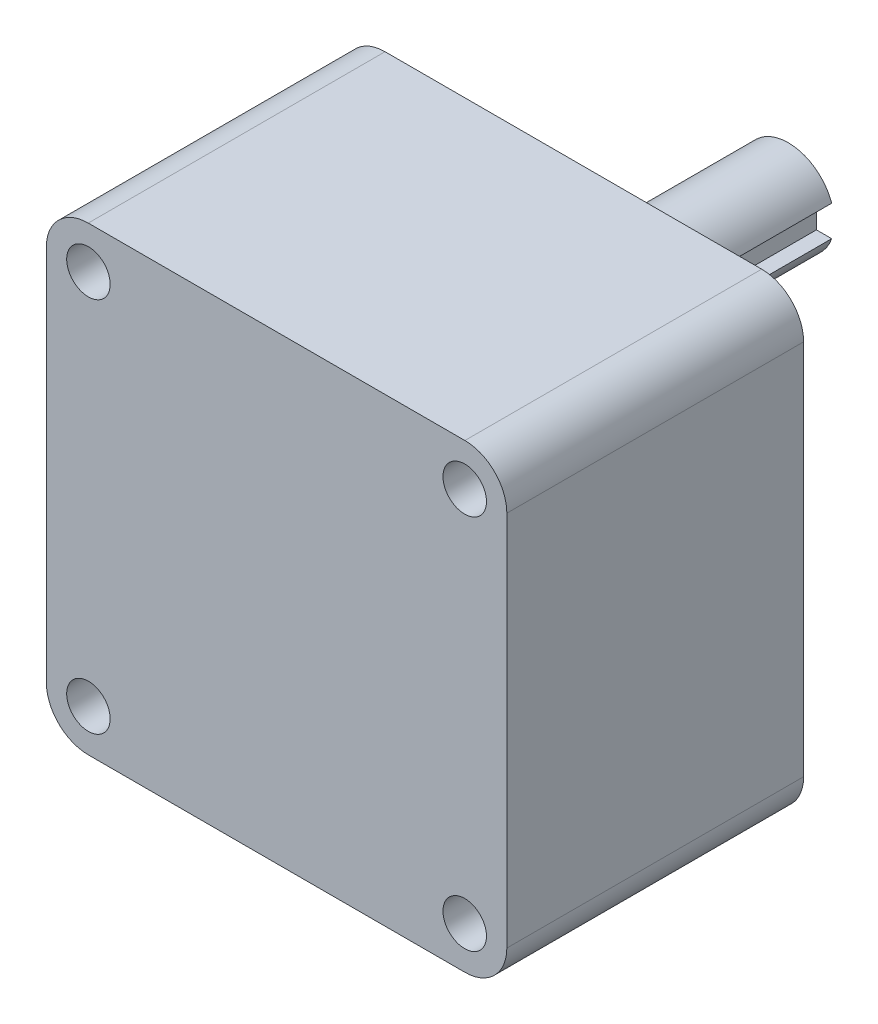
ISO-10303-21;
HEADER;
FILE_DESCRIPTION(('STEP AP214'),'2;1');
FILE_NAME('part.step','',(''),(''),'','','');
FILE_SCHEMA(('AUTOMOTIVE_DESIGN { 1 0 10303 214 1 1 1 1 }'));
ENDSEC;
DATA;
#1=APPLICATION_CONTEXT('core data for automotive mechanical design processes');
#2=APPLICATION_PROTOCOL_DEFINITION('international standard','automotive_design',2000,#1);
#3=PRODUCT_CONTEXT('',#1,'mechanical');
#4=PRODUCT('Part','Part','',(#3));
#5=PRODUCT_RELATED_PRODUCT_CATEGORY('part','',(#4));
#6=PRODUCT_DEFINITION_FORMATION('','',#4);
#7=PRODUCT_DEFINITION_CONTEXT('part definition',#1,'design');
#8=PRODUCT_DEFINITION('design','',#6,#7);
#9=PRODUCT_DEFINITION_SHAPE('','',#8);
#10=(LENGTH_UNIT() NAMED_UNIT(*) SI_UNIT(.MILLI.,.METRE.));
#11=(NAMED_UNIT(*) PLANE_ANGLE_UNIT() SI_UNIT($,.RADIAN.));
#12=(NAMED_UNIT(*) SI_UNIT($,.STERADIAN.) SOLID_ANGLE_UNIT());
#13=UNCERTAINTY_MEASURE_WITH_UNIT(LENGTH_MEASURE(1.E-05),#10,'distance_accuracy_value','');
#14=(GEOMETRIC_REPRESENTATION_CONTEXT(3) GLOBAL_UNCERTAINTY_ASSIGNED_CONTEXT((#13)) GLOBAL_UNIT_ASSIGNED_CONTEXT((#10,
#11,#12)) REPRESENTATION_CONTEXT('',''));
#15=CARTESIAN_POINT('',(0.,0.,0.));
#16=DIRECTION('',(0.,0.,1.));
#17=DIRECTION('',(1.,0.,0.));
#18=AXIS2_PLACEMENT_3D('',#15,#16,#17);
#19=CARTESIAN_POINT('',(0.,21.25,-96.5));
#20=DIRECTION('',(0.,0.,-1.));
#21=DIRECTION('',(0.,-1.,0.));
#22=AXIS2_PLACEMENT_3D('',#19,#20,#21);
#23=PLANE('',#22);
#24=CARTESIAN_POINT('',(0.,18.,-96.5));
#25=DIRECTION('',(0.,0.,1.));
#26=DIRECTION('',(-1.,0.,0.));
#27=AXIS2_PLACEMENT_3D('',#24,#25,#26);
#28=CIRCLE('',#27,2.5);
#29=CARTESIAN_POINT('',(-2.5,18.,-96.5));
#30=VERTEX_POINT('',#29);
#31=EDGE_CURVE('E323',#30,#30,#28,.T.);
#32=ORIENTED_EDGE('',*,*,#31,.T.);
#33=EDGE_LOOP('',(#32));
#34=FACE_BOUND('',#33,.T.);
#35=CARTESIAN_POINT('',(0.,18.,-96.5));
#36=DIRECTION('',(0.,0.,-1.));
#37=DIRECTION('',(1.,0.,0.));
#38=AXIS2_PLACEMENT_3D('',#35,#36,#37);
#39=CIRCLE('',#38,3.25);
#40=CARTESIAN_POINT('',(3.25,18.,-96.5));
#41=VERTEX_POINT('',#40);
#42=EDGE_CURVE('E331',#41,#41,#39,.T.);
#43=ORIENTED_EDGE('',*,*,#42,.T.);
#44=EDGE_LOOP('',(#43));
#45=FACE_BOUND('',#44,.T.);
#46=ADVANCED_FACE('F16',(#34,#45),#23,.T.);
#47=CARTESIAN_POINT('',(5.5,18.,-78.));
#48=DIRECTION('',(1.,0.,0.));
#49=DIRECTION('',(0.,1.,0.));
#50=AXIS2_PLACEMENT_3D('',#47,#48,#49);
#51=PLANE('',#50);
#52=CARTESIAN_POINT('',(5.5,18.,-78.));
#53=DIRECTION('',(1.,0.,0.));
#54=DIRECTION('',(0.,0.,-1.));
#55=AXIS2_PLACEMENT_3D('',#52,#53,#54);
#56=CIRCLE('',#55,3.);
#57=CARTESIAN_POINT('',(5.5,21.,-78.));
#58=VERTEX_POINT('',#57);
#59=CARTESIAN_POINT('',(5.5,15.,-78.));
#60=VERTEX_POINT('',#59);
#61=EDGE_CURVE('E353',#58,#60,#56,.T.);
#62=ORIENTED_EDGE('',*,*,#61,.T.);
#63=DIRECTION('',(0.,0.,-1.));
#64=VECTOR('',#63,1.);
#65=CARTESIAN_POINT('',(5.5,15.,-78.));
#66=LINE('',#65,#64);
#67=CARTESIAN_POINT('',(5.5,15.,-100.));
#68=VERTEX_POINT('',#67);
#69=EDGE_CURVE('E521',#60,#68,#66,.T.);
#70=ORIENTED_EDGE('',*,*,#69,.T.);
#71=DIRECTION('',(0.,1.,0.));
#72=VECTOR('',#71,1.);
#73=CARTESIAN_POINT('',(5.5,18.,-100.));
#74=LINE('',#73,#72);
#75=CARTESIAN_POINT('',(5.5,21.,-100.));
#76=VERTEX_POINT('',#75);
#77=EDGE_CURVE('E30',#68,#76,#74,.T.);
#78=ORIENTED_EDGE('',*,*,#77,.T.);
#79=DIRECTION('',(0.,0.,1.));
#80=VECTOR('',#79,1.);
#81=CARTESIAN_POINT('',(5.5,21.,-100.));
#82=LINE('',#81,#80);
#83=EDGE_CURVE('E10',#76,#58,#82,.T.);
#84=ORIENTED_EDGE('',*,*,#83,.T.);
#85=EDGE_LOOP('',(#62,#70,#78,#84));
#86=FACE_BOUND('',#85,.T.);
#87=ADVANCED_FACE('F752',(#86),#51,.T.);
#88=CARTESIAN_POINT('',(5.5,21.,-100.));
#89=DIRECTION('',(0.,1.,0.));
#90=DIRECTION('',(0.,0.,-1.));
#91=AXIS2_PLACEMENT_3D('',#88,#89,#90);
#92=PLANE('',#91);
#93=ORIENTED_EDGE('',*,*,#83,.F.);
#94=DIRECTION('',(1.,0.,0.));
#95=VECTOR('',#94,1.);
#96=CARTESIAN_POINT('',(0.,21.,-100.));
#97=LINE('',#96,#95);
#98=CARTESIAN_POINT('',(8.48528137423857,21.,-100.));
#99=VERTEX_POINT('',#98);
#100=EDGE_CURVE('E240',#76,#99,#97,.T.);
#101=ORIENTED_EDGE('',*,*,#100,.T.);
#102=DIRECTION('',(0.,0.,-1.));
#103=VECTOR('',#102,1.);
#104=CARTESIAN_POINT('',(8.48528137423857,21.,-36.1567686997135));
#105=LINE('',#104,#103);
#106=CARTESIAN_POINT('',(8.48528137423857,21.,-78.));
#107=VERTEX_POINT('',#106);
#108=EDGE_CURVE('E391',#107,#99,#105,.T.);
#109=ORIENTED_EDGE('',*,*,#108,.F.);
#110=DIRECTION('',(-1.,0.,0.));
#111=VECTOR('',#110,1.);
#112=CARTESIAN_POINT('',(5.5,21.,-78.));
#113=LINE('',#112,#111);
#114=EDGE_CURVE('E369',#107,#58,#113,.T.);
#115=ORIENTED_EDGE('',*,*,#114,.T.);
#116=EDGE_LOOP('',(#93,#101,#109,#115));
#117=FACE_BOUND('',#116,.T.);
#118=ADVANCED_FACE('F782',(#117),#92,.F.);
#119=CARTESIAN_POINT('',(0.,18.,-100.));
#120=DIRECTION('',(0.,0.,1.));
#121=DIRECTION('',(1.,0.,0.));
#122=AXIS2_PLACEMENT_3D('',#119,#120,#121);
#123=PLANE('',#122);
#124=CARTESIAN_POINT('',(0.,18.,-99.9999999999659));
#125=DIRECTION('',(0.,0.,-1.));
#126=DIRECTION('',(-1.,0.,0.));
#127=AXIS2_PLACEMENT_3D('',#124,#125,#126);
#128=CIRCLE('',#127,3.82735026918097);
#129=CARTESIAN_POINT('',(-3.82735026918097,18.,-99.9999999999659));
#130=VERTEX_POINT('',#129);
#131=EDGE_CURVE('E339',#130,#130,#128,.T.);
#132=ORIENTED_EDGE('',*,*,#131,.F.);
#133=EDGE_LOOP('',(#132));
#134=FACE_BOUND('',#133,.T.);
#135=DIRECTION('',(1.,0.,0.));
#136=VECTOR('',#135,1.);
#137=CARTESIAN_POINT('',(5.5,15.,-100.));
#138=LINE('',#137,#136);
#139=CARTESIAN_POINT('',(8.48528137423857,15.,-100.));
#140=VERTEX_POINT('',#139);
#141=EDGE_CURVE('E226',#68,#140,#138,.T.);
#142=ORIENTED_EDGE('',*,*,#141,.T.);
#143=CARTESIAN_POINT('',(0.,18.,-100.));
#144=DIRECTION('',(0.,0.,1.));
#145=DIRECTION('',(1.,0.,0.));
#146=AXIS2_PLACEMENT_3D('',#143,#144,#145);
#147=CIRCLE('',#146,9.);
#148=EDGE_CURVE('E390',#99,#140,#147,.T.);
#149=ORIENTED_EDGE('',*,*,#148,.F.);
#150=ORIENTED_EDGE('',*,*,#100,.F.);
#151=ORIENTED_EDGE('',*,*,#77,.F.);
#152=EDGE_LOOP('',(#142,#149,#150,#151));
#153=FACE_BOUND('',#152,.T.);
#154=ADVANCED_FACE('F777',(#134,#153),#123,.F.);
#155=CARTESIAN_POINT('',(5.5,15.,-78.));
#156=DIRECTION('',(0.,-1.,0.));
#157=DIRECTION('',(0.,0.,-1.));
#158=AXIS2_PLACEMENT_3D('',#155,#156,#157);
#159=PLANE('',#158);
#160=ORIENTED_EDGE('',*,*,#69,.F.);
#161=DIRECTION('',(1.,0.,0.));
#162=VECTOR('',#161,1.);
#163=CARTESIAN_POINT('',(5.5,15.,-78.));
#164=LINE('',#163,#162);
#165=CARTESIAN_POINT('',(8.48528137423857,15.,-78.));
#166=VERTEX_POINT('',#165);
#167=EDGE_CURVE('E464',#60,#166,#164,.T.);
#168=ORIENTED_EDGE('',*,*,#167,.T.);
#169=DIRECTION('',(0.,0.,1.));
#170=VECTOR('',#169,1.);
#171=CARTESIAN_POINT('',(8.48528137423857,15.,-36.1567686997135));
#172=LINE('',#171,#170);
#173=EDGE_CURVE('E361',#140,#166,#172,.T.);
#174=ORIENTED_EDGE('',*,*,#173,.F.);
#175=ORIENTED_EDGE('',*,*,#141,.F.);
#176=EDGE_LOOP('',(#160,#168,#174,#175));
#177=FACE_BOUND('',#176,.T.);
#178=ADVANCED_FACE('F476',(#177),#159,.F.);
#179=CARTESIAN_POINT('',(5.5,18.,-78.));
#180=DIRECTION('',(1.,0.,0.));
#181=DIRECTION('',(0.,0.,-1.));
#182=AXIS2_PLACEMENT_3D('',#179,#180,#181);
#183=CYLINDRICAL_SURFACE('',#182,3.);
#184=ORIENTED_EDGE('',*,*,#61,.F.);
#185=ORIENTED_EDGE('',*,*,#114,.F.);
#186=CARTESIAN_POINT('',(9.,18.,-75.));
#187=CARTESIAN_POINT('',(9.00000060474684,18.0397618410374,-74.999998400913));
#188=CARTESIAN_POINT('',(8.99973651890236,18.079524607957,-75.0007637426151));
#189=CARTESIAN_POINT('',(8.99868599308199,18.1587759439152,-75.0038396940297));
#190=CARTESIAN_POINT('',(8.99790227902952,18.1982648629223,-75.0061422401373));
#191=CARTESIAN_POINT('',(8.99582327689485,18.2769620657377,-75.0122922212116));
#192=CARTESIAN_POINT('',(8.99452989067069,18.3161708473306,-75.0161339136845));
#193=CARTESIAN_POINT('',(8.99144324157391,18.3943011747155,-75.0253593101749));
#194=CARTESIAN_POINT('',(8.98965106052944,18.4332231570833,-75.0307396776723));
#195=CARTESIAN_POINT('',(8.98557826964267,18.5107739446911,-75.0430401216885));
#196=CARTESIAN_POINT('',(8.98329794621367,18.5494029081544,-75.0499592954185));
#197=CARTESIAN_POINT('',(8.97826035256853,18.6263621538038,-75.0653348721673));
#198=CARTESIAN_POINT('',(8.97550261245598,18.6646921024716,-75.0737927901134));
#199=CARTESIAN_POINT('',(8.96952159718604,18.7410483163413,-75.0922434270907));
#200=CARTESIAN_POINT('',(8.96629714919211,18.7790735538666,-75.1022400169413));
#201=CARTESIAN_POINT('',(8.95939407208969,18.8548157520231,-75.1237657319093));
#202=CARTESIAN_POINT('',(8.95571363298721,18.8925308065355,-75.1353009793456));
#203=CARTESIAN_POINT('',(8.94790981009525,18.9676486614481,-75.1599015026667));
#204=CARTESIAN_POINT('',(8.94378405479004,19.005048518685,-75.1729750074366));
#205=CARTESIAN_POINT('',(8.93510084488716,19.0795317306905,-75.2006510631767));
#206=CARTESIAN_POINT('',(8.93054054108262,19.1166109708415,-75.2152637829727));
#207=CARTESIAN_POINT('',(8.92107986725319,19.1898254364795,-75.2457515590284));
#208=CARTESIAN_POINT('',(8.91618273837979,19.2259660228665,-75.2616147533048));
#209=CARTESIAN_POINT('',(8.90607040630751,19.2973835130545,-75.2946235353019));
#210=CARTESIAN_POINT('',(8.90085696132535,19.3326638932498,-75.3117621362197));
#211=CARTESIAN_POINT('',(8.89014197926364,19.4023601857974,-75.3473208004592));
#212=CARTESIAN_POINT('',(8.88464158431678,19.4367788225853,-75.3657358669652));
#213=CARTESIAN_POINT('',(8.87338178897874,19.5047523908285,-75.4038451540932));
#214=CARTESIAN_POINT('',(8.86762300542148,19.5383091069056,-75.4235363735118));
#215=CARTESIAN_POINT('',(8.85587476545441,19.6045600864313,-75.4641960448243));
#216=CARTESIAN_POINT('',(8.84988549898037,19.6372550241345,-75.4851634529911));
#217=CARTESIAN_POINT('',(8.83770380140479,19.7017844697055,-75.5283734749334));
#218=CARTESIAN_POINT('',(8.83151123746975,19.7336183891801,-75.5506169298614));
#219=CARTESIAN_POINT('',(8.81894969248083,19.7964282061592,-75.5963773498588));
#220=CARTESIAN_POINT('',(8.81258036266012,19.8274021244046,-75.6198969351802));
#221=CARTESIAN_POINT('',(8.7996910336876,19.8884956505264,-75.6682072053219));
#222=CARTESIAN_POINT('',(8.79317057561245,19.9186117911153,-75.6930021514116));
#223=CARTESIAN_POINT('',(8.78000460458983,19.9779911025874,-75.7438639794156));
#224=CARTESIAN_POINT('',(8.77335862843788,20.0072492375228,-75.7699366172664));
#225=CARTESIAN_POINT('',(8.75996384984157,20.064924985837,-75.8233431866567));
#226=CARTESIAN_POINT('',(8.7532146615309,20.0933360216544,-75.8506841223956));
#227=CARTESIAN_POINT('',(8.73978330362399,20.1487180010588,-75.9060883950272));
#228=CARTESIAN_POINT('',(8.73310138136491,20.1757027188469,-75.934138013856));
#229=CARTESIAN_POINT('',(8.71977397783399,20.2285159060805,-75.9912568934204));
#230=CARTESIAN_POINT('',(8.71312846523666,20.2543455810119,-76.0203250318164));
#231=CARTESIAN_POINT('',(8.6999013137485,20.3048642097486,-76.0794702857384));
#232=CARTESIAN_POINT('',(8.69331970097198,20.3295527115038,-76.1095477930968));
#233=CARTESIAN_POINT('',(8.68024895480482,20.3777939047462,-76.1707127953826));
#234=CARTESIAN_POINT('',(8.67376001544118,20.401344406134,-76.201802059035));
#235=CARTESIAN_POINT('',(8.66090104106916,20.4473178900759,-76.2649882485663));
#236=CARTESIAN_POINT('',(8.65453146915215,20.4697368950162,-76.2970881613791));
#237=CARTESIAN_POINT('',(8.64192748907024,20.5134857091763,-76.3623432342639));
#238=CARTESIAN_POINT('',(8.63569415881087,20.5348079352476,-76.3955036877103));
#239=CARTESIAN_POINT('',(8.6234911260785,20.5760161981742,-76.4624279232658));
#240=CARTESIAN_POINT('',(8.61751989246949,20.5959111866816,-76.4961859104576));
#241=CARTESIAN_POINT('',(8.60587019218,20.6342737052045,-76.5643037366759));
#242=CARTESIAN_POINT('',(8.60019029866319,20.6527484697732,-76.5986592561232));
#243=CARTESIAN_POINT('',(8.58914911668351,20.688282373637,-76.6679695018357));
#244=CARTESIAN_POINT('',(8.58378665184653,20.705346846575,-76.7029213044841));
#245=CARTESIAN_POINT('',(8.57340806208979,20.7380592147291,-76.773427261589));
#246=CARTESIAN_POINT('',(8.56839113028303,20.7537104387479,-76.8089797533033));
#247=CARTESIAN_POINT('',(8.55856478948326,20.7841033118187,-76.8817727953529));
#248=CARTESIAN_POINT('',(8.55376609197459,20.7988036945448,-76.9190320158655));
#249=CARTESIAN_POINT('',(8.54461026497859,20.8266319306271,-76.9938319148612));
#250=CARTESIAN_POINT('',(8.54024981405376,20.83977177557,-77.0313677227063));
#251=CARTESIAN_POINT('',(8.53199496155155,20.8644773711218,-77.1067240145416));
#252=CARTESIAN_POINT('',(8.52809763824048,20.8760530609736,-77.1445409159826));
#253=CARTESIAN_POINT('',(8.5207865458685,20.8976414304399,-77.220456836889));
#254=CARTESIAN_POINT('',(8.51737043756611,20.9076616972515,-77.2585534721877));
#255=CARTESIAN_POINT('',(8.51103771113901,20.9261463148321,-77.3350280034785));
#256=CARTESIAN_POINT('',(8.50811946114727,20.9346157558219,-77.3734045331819));
#257=CARTESIAN_POINT('',(8.50279542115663,20.9500061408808,-77.4504377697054));
#258=CARTESIAN_POINT('',(8.50038881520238,20.9569295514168,-77.4890939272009));
#259=CARTESIAN_POINT('',(8.49609852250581,20.9692343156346,-77.5666856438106));
#260=CARTESIAN_POINT('',(8.49421491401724,20.9746154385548,-77.6056212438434));
#261=CARTESIAN_POINT('',(8.49097835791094,20.983841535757,-77.6837713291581));
#262=CARTESIAN_POINT('',(8.48962642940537,20.9876835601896,-77.7229862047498));
#263=CARTESIAN_POINT('',(8.48745887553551,20.9938358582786,-77.8016943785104));
#264=CARTESIAN_POINT('',(8.48664522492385,20.9961404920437,-77.8411881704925));
#265=CARTESIAN_POINT('',(8.4855557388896,20.9992239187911,-77.9204547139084));
#266=CARTESIAN_POINT('',(8.48528280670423,20.9999944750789,-77.9602278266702));
#267=CARTESIAN_POINT('',(8.48528137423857,21.,-78.));
#268=B_SPLINE_CURVE_WITH_KNOTS('',3,(#186,#187,#188,#189,#190,#191,#192,#193,#194,#195,#196,
#197,#198,#199,#200,#201,#202,#203,#204,#205,#206,#207,#208,#209,#210,#211,#212,#213,#214,#215,
#216,#217,#218,#219,#220,#221,#222,#223,#224,#225,#226,#227,#228,#229,#230,#231,#232,#233,#234,
#235,#236,#237,#238,#239,#240,#241,#242,#243,#244,#245,#246,#247,#248,#249,#250,#251,#252,#253,
#254,#255,#256,#257,#258,#259,#260,#261,#262,#263,#264,#265,#266,#267),.UNSPECIFIED.,.F.,.F.,(4,
2,2,2,2,2,2,2,2,2,2,2,2,2,2,2,2,2,2,2,2,2,2,2,2,2,2,2,2,2,2,2,2,2,2,2,2,2,2,2,4),(0.,
0.119278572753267,0.237936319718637,0.356155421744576,0.474120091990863,0.592015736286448,
0.710028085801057,0.828342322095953,0.947142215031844,1.06660929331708,1.18692206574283,
1.30620610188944,1.42487898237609,1.54311102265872,1.66107444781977,1.77894266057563,
1.89688948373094,2.01508839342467,2.13371175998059,2.252930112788,2.37291144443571,
2.49135770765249,2.60967732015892,2.72804340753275,2.84662889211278,2.96560573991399,
3.08531748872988,3.20419723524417,3.32242458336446,3.44018212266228,3.55765463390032,
3.67864451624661,3.79863452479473,3.9178220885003,4.03640864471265,4.15459870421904,
4.27259883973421,4.39061662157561,4.50885952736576,4.62753385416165,4.74684366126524),.UNSPECIFIED.);
#269=CARTESIAN_POINT('',(9.,18.,-75.));
#270=VERTEX_POINT('',#269);
#271=EDGE_CURVE('E424',#270,#107,#268,.T.);
#272=ORIENTED_EDGE('',*,*,#271,.F.);
#273=CARTESIAN_POINT('',(8.48528137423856,15.,-78.));
#274=CARTESIAN_POINT('',(8.48528265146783,15.0000050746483,-77.9603081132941));
#275=CARTESIAN_POINT('',(8.48555444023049,15.0007724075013,-77.9206152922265));
#276=CARTESIAN_POINT('',(8.4866396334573,15.0038436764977,-77.8415068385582));
#277=CARTESIAN_POINT('',(8.48745016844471,15.0061394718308,-77.8020908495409));
#278=CARTESIAN_POINT('',(8.48960951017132,15.0122683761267,-77.7235357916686));
#279=CARTESIAN_POINT('',(8.49095636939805,15.0160959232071,-77.6843962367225));
#280=CARTESIAN_POINT('',(8.49418086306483,15.0252873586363,-77.6063942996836));
#281=CARTESIAN_POINT('',(8.49605749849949,15.0306483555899,-77.5675315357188));
#282=CARTESIAN_POINT('',(8.50033198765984,15.042907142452,-77.4900829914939));
#283=CARTESIAN_POINT('',(8.50272977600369,15.0498047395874,-77.4514971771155));
#284=CARTESIAN_POINT('',(8.50803443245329,15.0651378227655,-77.3746021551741));
#285=CARTESIAN_POINT('',(8.5109421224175,15.0735757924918,-77.3362934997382));
#286=CARTESIAN_POINT('',(8.51725201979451,15.091991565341,-77.2599521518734));
#287=CARTESIAN_POINT('',(8.52065585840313,15.1019744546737,-77.2219208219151));
#288=CARTESIAN_POINT('',(8.52794108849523,15.1234829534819,-77.1461333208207));
#289=CARTESIAN_POINT('',(8.53182481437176,15.1350161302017,-77.1083795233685));
#290=CARTESIAN_POINT('',(8.5400503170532,15.1596285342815,-77.0331458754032));
#291=CARTESIAN_POINT('',(8.54439500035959,15.172717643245,-76.9956695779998));
#292=CARTESIAN_POINT('',(8.55352097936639,15.2004476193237,-76.9209903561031));
#293=CARTESIAN_POINT('',(8.55830560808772,15.215100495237,-76.8837923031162));
#294=CARTESIAN_POINT('',(8.5681495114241,15.2455371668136,-76.8106784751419));
#295=CARTESIAN_POINT('',(8.57320246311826,15.2612964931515,-76.774751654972));
#296=CARTESIAN_POINT('',(8.58361163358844,15.2940979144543,-76.7037151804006));
#297=CARTESIAN_POINT('',(8.58896651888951,15.3111344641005,-76.6686027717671));
#298=CARTESIAN_POINT('',(8.59995682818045,15.3464958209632,-76.5991951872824));
#299=CARTESIAN_POINT('',(8.60559148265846,15.364817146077,-76.5648981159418));
#300=CARTESIAN_POINT('',(8.61711649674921,15.4027522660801,-76.4971200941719));
#301=CARTESIAN_POINT('',(8.62300657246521,15.4223646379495,-76.4636382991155));
#302=CARTESIAN_POINT('',(8.63501607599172,15.4628866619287,-76.3974898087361));
#303=CARTESIAN_POINT('',(8.64113560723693,15.4837969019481,-76.3648234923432));
#304=CARTESIAN_POINT('',(8.6535759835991,15.5269194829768,-76.3003046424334));
#305=CARTESIAN_POINT('',(8.65989720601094,15.5491343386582,-76.2684538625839));
#306=CARTESIAN_POINT('',(8.67271134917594,15.5948713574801,-76.2055648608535));
#307=CARTESIAN_POINT('',(8.67920479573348,15.618397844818,-76.1745298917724));
#308=CARTESIAN_POINT('',(8.69233193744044,15.6667626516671,-76.1132703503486));
#309=CARTESIAN_POINT('',(8.69896617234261,15.6916069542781,-76.0830506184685));
#310=CARTESIAN_POINT('',(8.7123425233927,15.742614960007,-76.0234223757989));
#311=CARTESIAN_POINT('',(8.71908505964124,15.7687861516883,-75.9940203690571));
#312=CARTESIAN_POINT('',(8.73264126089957,15.822444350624,-75.9360168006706));
#313=CARTESIAN_POINT('',(8.73945506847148,15.8499400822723,-75.907423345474));
#314=CARTESIAN_POINT('',(8.75291798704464,15.9054297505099,-75.8519259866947));
#315=CARTESIAN_POINT('',(8.75956750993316,15.933400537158,-75.8249990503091));
#316=CARTESIAN_POINT('',(8.77281870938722,15.9903961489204,-75.7722590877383));
#317=CARTESIAN_POINT('',(8.77942037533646,16.0194211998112,-75.746446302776));
#318=CARTESIAN_POINT('',(8.79254390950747,16.0785189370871,-75.6959239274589));
#319=CARTESIAN_POINT('',(8.79906562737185,16.1085932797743,-75.6712162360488));
#320=CARTESIAN_POINT('',(8.81199903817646,16.1697939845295,-75.6229048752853));
#321=CARTESIAN_POINT('',(8.81841032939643,16.2009233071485,-75.5993048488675));
#322=CARTESIAN_POINT('',(8.83109086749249,16.2642347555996,-75.5532061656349));
#323=CARTESIAN_POINT('',(8.83735934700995,16.2964209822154,-75.5307129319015));
#324=CARTESIAN_POINT('',(8.84969236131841,16.3616930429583,-75.4869316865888));
#325=CARTESIAN_POINT('',(8.85575666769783,16.3947798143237,-75.4656450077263));
#326=CARTESIAN_POINT('',(8.86760850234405,16.4616033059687,-75.424472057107));
#327=CARTESIAN_POINT('',(8.87339738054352,16.4953353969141,-75.4045786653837));
#328=CARTESIAN_POINT('',(8.88467796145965,16.5634471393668,-75.3661912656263));
#329=CARTESIAN_POINT('',(8.89017079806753,16.5978235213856,-75.3476917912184));
#330=CARTESIAN_POINT('',(8.90083853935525,16.6672200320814,-75.3120878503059));
#331=CARTESIAN_POINT('',(8.90601426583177,16.7022381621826,-75.2949797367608));
#332=CARTESIAN_POINT('',(8.91602741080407,16.7729191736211,-75.262166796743));
#333=CARTESIAN_POINT('',(8.92086524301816,16.8085811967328,-75.2464602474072));
#334=CARTESIAN_POINT('',(8.9302879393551,16.8813688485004,-75.2160608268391));
#335=CARTESIAN_POINT('',(8.93486417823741,16.9185091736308,-75.2014004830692));
#336=CARTESIAN_POINT('',(8.94357757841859,16.9931133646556,-75.1736258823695));
#337=CARTESIAN_POINT('',(8.94771760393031,17.0305731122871,-75.1605014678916));
#338=CARTESIAN_POINT('',(8.95554879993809,17.1058142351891,-75.1358073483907));
#339=CARTESIAN_POINT('',(8.95924234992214,17.1435926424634,-75.1242293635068));
#340=CARTESIAN_POINT('',(8.96617021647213,17.2194637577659,-75.1026233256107));
#341=CARTESIAN_POINT('',(8.96940634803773,17.2575545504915,-75.0925891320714));
#342=CARTESIAN_POINT('',(8.97540923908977,17.3340443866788,-75.0740692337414));
#343=CARTESIAN_POINT('',(8.97817717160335,17.372442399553,-75.0655796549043));
#344=CARTESIAN_POINT('',(8.98323354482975,17.4495401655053,-75.0501464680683));
#345=CARTESIAN_POINT('',(8.98552245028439,17.488239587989,-75.0432013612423));
#346=CARTESIAN_POINT('',(8.98961070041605,17.5659336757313,-75.0308548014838));
#347=CARTESIAN_POINT('',(8.9914097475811,17.6049285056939,-75.0254542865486));
#348=CARTESIAN_POINT('',(8.994508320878,17.683206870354,-75.0161943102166));
#349=CARTESIAN_POINT('',(8.99580674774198,17.7224908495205,-75.0123382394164));
#350=CARTESIAN_POINT('',(8.99789391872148,17.8013407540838,-75.006165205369));
#351=CARTESIAN_POINT('',(8.99868073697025,17.8409071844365,-75.0038540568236));
#352=CARTESIAN_POINT('',(8.9997354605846,17.9203158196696,-75.0007665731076));
#353=CARTESIAN_POINT('',(9.0000006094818,17.9601583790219,-74.9999983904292));
#354=CARTESIAN_POINT('',(9.,18.,-75.));
#355=B_SPLINE_CURVE_WITH_KNOTS('',3,(#273,#274,#275,#276,#277,#278,#279,#280,#281,#282,#283,
#284,#285,#286,#287,#288,#289,#290,#291,#292,#293,#294,#295,#296,#297,#298,#299,#300,#301,#302,
#303,#304,#305,#306,#307,#308,#309,#310,#311,#312,#313,#314,#315,#316,#317,#318,#319,#320,#321,
#322,#323,#324,#325,#326,#327,#328,#329,#330,#331,#332,#333,#334,#335,#336,#337,#338,#339,#340,
#341,#342,#343,#344,#345,#346,#347,#348,#349,#350,#351,#352,#353,#354),.UNSPECIFIED.,.F.,.F.,(4,
2,2,2,2,2,2,2,2,2,2,2,2,2,2,2,2,2,2,2,2,2,2,2,2,2,2,2,2,2,2,2,2,2,2,2,2,2,2,2,4),(0.,
0.119068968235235,0.23750877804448,0.355522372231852,0.47331489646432,0.591092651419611,
0.709062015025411,0.827428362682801,0.946395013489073,1.06616222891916,1.18692628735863,
1.30556297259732,1.42371147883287,1.54155130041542,1.65926334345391,1.77702910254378,
1.8950298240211,2.01344567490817,2.13245493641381,2.25223323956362,2.37295285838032,
2.49109655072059,2.60926569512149,2.72763065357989,2.84636094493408,2.96562452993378,
3.08501738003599,3.20374725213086,3.32198424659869,3.43990059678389,3.55766994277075,
3.67820902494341,3.79789954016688,3.91692105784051,4.0354561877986,4.1536897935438,
4.27180815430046,4.38999809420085,4.50844609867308,4.62733743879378,4.74685532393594),.UNSPECIFIED.);
#356=EDGE_CURVE('E395',#166,#270,#355,.T.);
#357=ORIENTED_EDGE('',*,*,#356,.F.);
#358=ORIENTED_EDGE('',*,*,#167,.F.);
#359=EDGE_LOOP('',(#184,#185,#272,#357,#358));
#360=FACE_BOUND('',#359,.T.);
#361=ADVANCED_FACE('F470',(#360),#183,.F.);
#362=CARTESIAN_POINT('',(0.,18.,-66.));
#363=DIRECTION('',(0.,0.,1.));
#364=DIRECTION('',(1.,0.,0.));
#365=AXIS2_PLACEMENT_3D('',#362,#363,#364);
#366=PLANE('',#365);
#367=CARTESIAN_POINT('',(0.,18.,-66.));
#368=DIRECTION('',(0.,0.,-1.));
#369=DIRECTION('',(1.,0.,0.));
#370=AXIS2_PLACEMENT_3D('',#367,#368,#369);
#371=CIRCLE('',#370,9.);
#372=CARTESIAN_POINT('',(9.,18.,-66.));
#373=VERTEX_POINT('',#372);
#374=EDGE_CURVE('E218',#373,#373,#371,.T.);
#375=ORIENTED_EDGE('',*,*,#374,.F.);
#376=EDGE_LOOP('',(#375));
#377=FACE_BOUND('',#376,.T.);
#378=CARTESIAN_POINT('',(0.,18.,-66.));
#379=DIRECTION('',(0.,0.,1.));
#380=DIRECTION('',(1.,0.,0.));
#381=AXIS2_PLACEMENT_3D('',#378,#379,#380);
#382=CIRCLE('',#381,10.);
#383=CARTESIAN_POINT('',(-10.,18.,-66.));
#384=VERTEX_POINT('',#383);
#385=EDGE_CURVE('E357',#384,#384,#382,.T.);
#386=ORIENTED_EDGE('',*,*,#385,.F.);
#387=EDGE_LOOP('',(#386));
#388=FACE_BOUND('',#387,.T.);
#389=ADVANCED_FACE('F480',(#377,#388),#366,.F.);
#390=CARTESIAN_POINT('',(0.,18.,-63.));
#391=DIRECTION('',(0.,0.,1.));
#392=DIRECTION('',(1.,0.,0.));
#393=AXIS2_PLACEMENT_3D('',#390,#391,#392);
#394=PLANE('',#393);
#395=CARTESIAN_POINT('',(0.,18.,-63.));
#396=DIRECTION('',(0.,0.,-1.));
#397=DIRECTION('',(1.,0.,0.));
#398=AXIS2_PLACEMENT_3D('',#395,#396,#397);
#399=CIRCLE('',#398,10.);
#400=CARTESIAN_POINT('',(10.,18.,-63.));
#401=VERTEX_POINT('',#400);
#402=EDGE_CURVE('E392',#401,#401,#399,.T.);
#403=ORIENTED_EDGE('',*,*,#402,.F.);
#404=EDGE_LOOP('',(#403));
#405=FACE_BOUND('',#404,.T.);
#406=CARTESIAN_POINT('',(0.,18.,-63.));
#407=DIRECTION('',(0.,0.,1.));
#408=DIRECTION('',(1.,0.,0.));
#409=AXIS2_PLACEMENT_3D('',#406,#407,#408);
#410=CIRCLE('',#409,19.5);
#411=CARTESIAN_POINT('',(-19.5,18.,-63.));
#412=VERTEX_POINT('',#411);
#413=EDGE_CURVE('E359',#412,#412,#410,.T.);
#414=ORIENTED_EDGE('',*,*,#413,.F.);
#415=EDGE_LOOP('',(#414));
#416=FACE_BOUND('',#415,.T.);
#417=ADVANCED_FACE('F763',(#405,#416),#394,.F.);
#418=CARTESIAN_POINT('',(0.,0.,-57.6));
#419=DIRECTION('',(0.,0.,1.));
#420=DIRECTION('',(1.,0.,0.));
#421=AXIS2_PLACEMENT_3D('',#418,#419,#420);
#422=PLANE('',#421);
#423=CARTESIAN_POINT('',(0.,18.,-57.6));
#424=DIRECTION('',(0.,0.,-1.));
#425=DIRECTION('',(1.,0.,0.));
#426=AXIS2_PLACEMENT_3D('',#423,#424,#425);
#427=CIRCLE('',#426,19.5);
#428=CARTESIAN_POINT('',(19.5,18.,-57.6));
#429=VERTEX_POINT('',#428);
#430=EDGE_CURVE('E356',#429,#429,#427,.T.);
#431=ORIENTED_EDGE('',*,*,#430,.F.);
#432=EDGE_LOOP('',(#431));
#433=FACE_BOUND('',#432,.T.);
#434=CARTESIAN_POINT('',(0.,0.,-57.6));
#435=DIRECTION('',(0.,0.,-1.));
#436=DIRECTION('',(-1.,0.,0.));
#437=AXIS2_PLACEMENT_3D('',#434,#435,#436);
#438=CIRCLE('',#437,41.5);
#439=CARTESIAN_POINT('',(-41.5,0.,-57.6));
#440=VERTEX_POINT('',#439);
#441=EDGE_CURVE('E367',#440,#440,#438,.T.);
#442=ORIENTED_EDGE('',*,*,#441,.T.);
#443=EDGE_LOOP('',(#442));
#444=FACE_BOUND('',#443,.T.);
#445=ADVANCED_FACE('F846',(#433,#444),#422,.F.);
#446=CARTESIAN_POINT('',(45.,-45.,-58.));
#447=DIRECTION('',(0.,0.,1.));
#448=DIRECTION('',(1.,0.,0.));
#449=AXIS2_PLACEMENT_3D('',#446,#447,#448);
#450=PLANE('',#449);
#451=CARTESIAN_POINT('',(-36.7695526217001,-36.7695526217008,-58.));
#452=DIRECTION('',(0.,0.,1.));
#453=DIRECTION('',(1.,0.,0.));
#454=AXIS2_PLACEMENT_3D('',#451,#452,#453);
#455=CIRCLE('',#454,4.25);
#456=CARTESIAN_POINT('',(-32.5195526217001,-36.7695526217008,-58.));
#457=VERTEX_POINT('',#456);
#458=EDGE_CURVE('E307',#457,#457,#455,.T.);
#459=ORIENTED_EDGE('',*,*,#458,.T.);
#460=EDGE_LOOP('',(#459));
#461=FACE_BOUND('',#460,.T.);
#462=CARTESIAN_POINT('',(-36.7695526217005,36.7695526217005,-58.));
#463=DIRECTION('',(0.,0.,1.));
#464=DIRECTION('',(1.,0.,0.));
#465=AXIS2_PLACEMENT_3D('',#462,#463,#464);
#466=CIRCLE('',#465,4.25);
#467=CARTESIAN_POINT('',(-32.5195526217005,36.7695526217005,-58.));
#468=VERTEX_POINT('',#467);
#469=EDGE_CURVE('E306',#468,#468,#466,.T.);
#470=ORIENTED_EDGE('',*,*,#469,.T.);
#471=EDGE_LOOP('',(#470));
#472=FACE_BOUND('',#471,.T.);
#473=CARTESIAN_POINT('',(36.7695526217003,36.7695526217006,-58.));
#474=DIRECTION('',(0.,0.,1.));
#475=DIRECTION('',(1.,0.,0.));
#476=AXIS2_PLACEMENT_3D('',#473,#474,#475);
#477=CIRCLE('',#476,4.25);
#478=CARTESIAN_POINT('',(41.0195526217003,36.7695526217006,-58.));
#479=VERTEX_POINT('',#478);
#480=EDGE_CURVE('E327',#479,#479,#477,.T.);
#481=ORIENTED_EDGE('',*,*,#480,.T.);
#482=EDGE_LOOP('',(#481));
#483=FACE_BOUND('',#482,.T.);
#484=CARTESIAN_POINT('',(36.7695526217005,-36.7695526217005,-58.));
#485=DIRECTION('',(0.,0.,1.));
#486=DIRECTION('',(1.,0.,0.));
#487=AXIS2_PLACEMENT_3D('',#484,#485,#486);
#488=CIRCLE('',#487,4.25);
#489=CARTESIAN_POINT('',(41.0195526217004,-36.7695526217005,-58.));
#490=VERTEX_POINT('',#489);
#491=EDGE_CURVE('E404',#490,#490,#488,.T.);
#492=ORIENTED_EDGE('',*,*,#491,.T.);
#493=EDGE_LOOP('',(#492));
#494=FACE_BOUND('',#493,.T.);
#495=CARTESIAN_POINT('',(0.,0.,-58.));
#496=DIRECTION('',(0.,0.,-1.));
#497=DIRECTION('',(-1.,0.,0.));
#498=AXIS2_PLACEMENT_3D('',#495,#496,#497);
#499=CIRCLE('',#498,41.5);
#500=CARTESIAN_POINT('',(-41.5,0.,-58.));
#501=VERTEX_POINT('',#500);
#502=EDGE_CURVE('E373',#501,#501,#499,.T.);
#503=ORIENTED_EDGE('',*,*,#502,.F.);
#504=EDGE_LOOP('',(#503));
#505=FACE_BOUND('',#504,.T.);
#506=CARTESIAN_POINT('',(-36.8,-36.8,-58.));
#507=DIRECTION('',(0.,0.,1.));
#508=DIRECTION('',(1.,0.,0.));
#509=AXIS2_PLACEMENT_3D('',#506,#507,#508);
#510=CIRCLE('',#509,8.2);
#511=CARTESIAN_POINT('',(-45.,-36.8,-58.));
#512=VERTEX_POINT('',#511);
#513=CARTESIAN_POINT('',(-36.8,-45.,-58.));
#514=VERTEX_POINT('',#513);
#515=EDGE_CURVE('E354',#512,#514,#510,.T.);
#516=ORIENTED_EDGE('',*,*,#515,.F.);
#517=DIRECTION('',(0.,-1.,0.));
#518=VECTOR('',#517,1.);
#519=CARTESIAN_POINT('',(-45.,45.,-58.));
#520=LINE('',#519,#518);
#521=CARTESIAN_POINT('',(-45.,36.8,-58.));
#522=VERTEX_POINT('',#521);
#523=EDGE_CURVE('E351',#522,#512,#520,.T.);
#524=ORIENTED_EDGE('',*,*,#523,.F.);
#525=CARTESIAN_POINT('',(-36.8,36.8,-58.));
#526=DIRECTION('',(0.,0.,1.));
#527=DIRECTION('',(1.,0.,0.));
#528=AXIS2_PLACEMENT_3D('',#525,#526,#527);
#529=CIRCLE('',#528,8.2);
#530=CARTESIAN_POINT('',(-36.8,45.,-58.));
#531=VERTEX_POINT('',#530);
#532=EDGE_CURVE('E338',#531,#522,#529,.T.);
#533=ORIENTED_EDGE('',*,*,#532,.F.);
#534=DIRECTION('',(-1.,0.,0.));
#535=VECTOR('',#534,1.);
#536=CARTESIAN_POINT('',(-45.,45.,-58.));
#537=LINE('',#536,#535);
#538=CARTESIAN_POINT('',(36.8,45.,-58.));
#539=VERTEX_POINT('',#538);
#540=EDGE_CURVE('E303',#539,#531,#537,.T.);
#541=ORIENTED_EDGE('',*,*,#540,.F.);
#542=CARTESIAN_POINT('',(36.8,36.8,-58.));
#543=DIRECTION('',(0.,0.,1.));
#544=DIRECTION('',(1.,0.,0.));
#545=AXIS2_PLACEMENT_3D('',#542,#543,#544);
#546=CIRCLE('',#545,8.2);
#547=CARTESIAN_POINT('',(45.,36.8,-58.));
#548=VERTEX_POINT('',#547);
#549=EDGE_CURVE('E284',#548,#539,#546,.T.);
#550=ORIENTED_EDGE('',*,*,#549,.F.);
#551=DIRECTION('',(0.,1.,0.));
#552=VECTOR('',#551,1.);
#553=CARTESIAN_POINT('',(45.,45.,-58.));
#554=LINE('',#553,#552);
#555=CARTESIAN_POINT('',(45.,-36.8,-58.));
#556=VERTEX_POINT('',#555);
#557=EDGE_CURVE('E255',#556,#548,#554,.T.);
#558=ORIENTED_EDGE('',*,*,#557,.F.);
#559=CARTESIAN_POINT('',(36.8,-36.8,-58.));
#560=DIRECTION('',(0.,0.,1.));
#561=DIRECTION('',(1.,0.,0.));
#562=AXIS2_PLACEMENT_3D('',#559,#560,#561);
#563=CIRCLE('',#562,8.2);
#564=CARTESIAN_POINT('',(36.8,-45.,-58.));
#565=VERTEX_POINT('',#564);
#566=EDGE_CURVE('E263',#565,#556,#563,.T.);
#567=ORIENTED_EDGE('',*,*,#566,.F.);
#568=DIRECTION('',(1.,0.,0.));
#569=VECTOR('',#568,1.);
#570=CARTESIAN_POINT('',(-45.,-45.,-58.));
#571=LINE('',#570,#569);
#572=EDGE_CURVE('E275',#514,#565,#571,.T.);
#573=ORIENTED_EDGE('',*,*,#572,.F.);
#574=EDGE_LOOP('',(#516,#524,#533,#541,#550,#558,#567,#573));
#575=FACE_BOUND('',#574,.T.);
#576=ADVANCED_FACE('F281',(#461,#472,#483,#494,#505,#575),#450,.F.);
#577=CARTESIAN_POINT('',(-45.,45.,-58.));
#578=DIRECTION('',(-1.,0.,0.));
#579=DIRECTION('',(0.,1.,0.));
#580=AXIS2_PLACEMENT_3D('',#577,#578,#579);
#581=PLANE('',#580);
#582=DIRECTION('',(0.,-1.,0.));
#583=VECTOR('',#582,1.);
#584=CARTESIAN_POINT('',(-45.,-45.,0.));
#585=LINE('',#584,#583);
#586=CARTESIAN_POINT('',(-45.,36.8,0.));
#587=VERTEX_POINT('',#586);
#588=CARTESIAN_POINT('',(-45.,-36.8,0.));
#589=VERTEX_POINT('',#588);
#590=EDGE_CURVE('E330',#587,#589,#585,.T.);
#591=ORIENTED_EDGE('',*,*,#590,.F.);
#592=DIRECTION('',(0.,0.,1.));
#593=VECTOR('',#592,1.);
#594=CARTESIAN_POINT('',(-45.,36.8,-58.));
#595=LINE('',#594,#593);
#596=EDGE_CURVE('E345',#522,#587,#595,.T.);
#597=ORIENTED_EDGE('',*,*,#596,.F.);
#598=ORIENTED_EDGE('',*,*,#523,.T.);
#599=DIRECTION('',(0.,0.,-1.));
#600=VECTOR('',#599,1.);
#601=CARTESIAN_POINT('',(-45.,-36.8,-58.));
#602=LINE('',#601,#600);
#603=EDGE_CURVE('E82',#589,#512,#602,.T.);
#604=ORIENTED_EDGE('',*,*,#603,.F.);
#605=EDGE_LOOP('',(#591,#597,#598,#604));
#606=FACE_BOUND('',#605,.T.);
#607=ADVANCED_FACE('F481',(#606),#581,.T.);
#608=CARTESIAN_POINT('',(-36.8,-36.8,-58.));
#609=DIRECTION('',(0.,0.,1.));
#610=DIRECTION('',(1.,0.,0.));
#611=AXIS2_PLACEMENT_3D('',#608,#609,#610);
#612=CYLINDRICAL_SURFACE('',#611,8.2);
#613=CARTESIAN_POINT('',(-36.8,-36.8,0.));
#614=DIRECTION('',(0.,0.,1.));
#615=DIRECTION('',(1.,0.,0.));
#616=AXIS2_PLACEMENT_3D('',#613,#614,#615);
#617=CIRCLE('',#616,8.2);
#618=CARTESIAN_POINT('',(-36.8,-45.,0.));
#619=VERTEX_POINT('',#618);
#620=EDGE_CURVE('E372',#589,#619,#617,.T.);
#621=ORIENTED_EDGE('',*,*,#620,.F.);
#622=ORIENTED_EDGE('',*,*,#603,.T.);
#623=ORIENTED_EDGE('',*,*,#515,.T.);
#624=DIRECTION('',(0.,0.,-1.));
#625=VECTOR('',#624,1.);
#626=CARTESIAN_POINT('',(-36.8,-45.,-58.));
#627=LINE('',#626,#625);
#628=EDGE_CURVE('E67',#619,#514,#627,.T.);
#629=ORIENTED_EDGE('',*,*,#628,.F.);
#630=EDGE_LOOP('',(#621,#622,#623,#629));
#631=FACE_BOUND('',#630,.T.);
#632=ADVANCED_FACE('F746',(#631),#612,.T.);
#633=CARTESIAN_POINT('',(-45.,-45.,-58.));
#634=DIRECTION('',(0.,-1.,0.));
#635=DIRECTION('',(0.,0.,-1.));
#636=AXIS2_PLACEMENT_3D('',#633,#634,#635);
#637=PLANE('',#636);
#638=ORIENTED_EDGE('',*,*,#572,.T.);
#639=DIRECTION('',(0.,0.,-1.));
#640=VECTOR('',#639,1.);
#641=CARTESIAN_POINT('',(36.8,-45.,-58.));
#642=LINE('',#641,#640);
#643=CARTESIAN_POINT('',(36.8,-45.,0.));
#644=VERTEX_POINT('',#643);
#645=EDGE_CURVE('E268',#644,#565,#642,.T.);
#646=ORIENTED_EDGE('',*,*,#645,.F.);
#647=DIRECTION('',(1.,0.,0.));
#648=VECTOR('',#647,1.);
#649=CARTESIAN_POINT('',(45.,-45.,0.));
#650=LINE('',#649,#648);
#651=EDGE_CURVE('E378',#619,#644,#650,.T.);
#652=ORIENTED_EDGE('',*,*,#651,.F.);
#653=ORIENTED_EDGE('',*,*,#628,.T.);
#654=EDGE_LOOP('',(#638,#646,#652,#653));
#655=FACE_BOUND('',#654,.T.);
#656=ADVANCED_FACE('F729',(#655),#637,.T.);
#657=CARTESIAN_POINT('',(36.8,-36.8,-58.));
#658=DIRECTION('',(0.,0.,1.));
#659=DIRECTION('',(1.,0.,0.));
#660=AXIS2_PLACEMENT_3D('',#657,#658,#659);
#661=CYLINDRICAL_SURFACE('',#660,8.2);
#662=CARTESIAN_POINT('',(36.8,-36.8,0.));
#663=DIRECTION('',(0.,0.,1.));
#664=DIRECTION('',(1.,0.,0.));
#665=AXIS2_PLACEMENT_3D('',#662,#663,#664);
#666=CIRCLE('',#665,8.2);
#667=CARTESIAN_POINT('',(45.,-36.8,0.));
#668=VERTEX_POINT('',#667);
#669=EDGE_CURVE('E314',#644,#668,#666,.T.);
#670=ORIENTED_EDGE('',*,*,#669,.F.);
#671=ORIENTED_EDGE('',*,*,#645,.T.);
#672=ORIENTED_EDGE('',*,*,#566,.T.);
#673=DIRECTION('',(0.,0.,-1.));
#674=VECTOR('',#673,1.);
#675=CARTESIAN_POINT('',(45.,-36.8,-58.));
#676=LINE('',#675,#674);
#677=EDGE_CURVE('E266',#668,#556,#676,.T.);
#678=ORIENTED_EDGE('',*,*,#677,.F.);
#679=EDGE_LOOP('',(#670,#671,#672,#678));
#680=FACE_BOUND('',#679,.T.);
#681=ADVANCED_FACE('F264',(#680),#661,.T.);
#682=CARTESIAN_POINT('',(45.,45.,-58.));
#683=DIRECTION('',(1.,0.,0.));
#684=DIRECTION('',(0.,1.,0.));
#685=AXIS2_PLACEMENT_3D('',#682,#683,#684);
#686=PLANE('',#685);
#687=ORIENTED_EDGE('',*,*,#557,.T.);
#688=DIRECTION('',(0.,0.,-1.));
#689=VECTOR('',#688,1.);
#690=CARTESIAN_POINT('',(45.,36.8,-58.));
#691=LINE('',#690,#689);
#692=CARTESIAN_POINT('',(45.,36.8,0.));
#693=VERTEX_POINT('',#692);
#694=EDGE_CURVE('E291',#693,#548,#691,.T.);
#695=ORIENTED_EDGE('',*,*,#694,.F.);
#696=DIRECTION('',(0.,1.,0.));
#697=VECTOR('',#696,1.);
#698=CARTESIAN_POINT('',(45.,-45.,0.));
#699=LINE('',#698,#697);
#700=EDGE_CURVE('E277',#668,#693,#699,.T.);
#701=ORIENTED_EDGE('',*,*,#700,.F.);
#702=ORIENTED_EDGE('',*,*,#677,.T.);
#703=EDGE_LOOP('',(#687,#695,#701,#702));
#704=FACE_BOUND('',#703,.T.);
#705=ADVANCED_FACE('F273',(#704),#686,.T.);
#706=CARTESIAN_POINT('',(36.8,36.8,-58.));
#707=DIRECTION('',(0.,0.,1.));
#708=DIRECTION('',(1.,0.,0.));
#709=AXIS2_PLACEMENT_3D('',#706,#707,#708);
#710=CYLINDRICAL_SURFACE('',#709,8.2);
#711=CARTESIAN_POINT('',(36.8,36.8,0.));
#712=DIRECTION('',(0.,0.,1.));
#713=DIRECTION('',(1.,0.,0.));
#714=AXIS2_PLACEMENT_3D('',#711,#712,#713);
#715=CIRCLE('',#714,8.2);
#716=CARTESIAN_POINT('',(36.8,45.,0.));
#717=VERTEX_POINT('',#716);
#718=EDGE_CURVE('E311',#693,#717,#715,.T.);
#719=ORIENTED_EDGE('',*,*,#718,.F.);
#720=ORIENTED_EDGE('',*,*,#694,.T.);
#721=ORIENTED_EDGE('',*,*,#549,.T.);
#722=DIRECTION('',(0.,0.,-1.));
#723=VECTOR('',#722,1.);
#724=CARTESIAN_POINT('',(36.8,45.,-58.));
#725=LINE('',#724,#723);
#726=EDGE_CURVE('E298',#717,#539,#725,.T.);
#727=ORIENTED_EDGE('',*,*,#726,.F.);
#728=EDGE_LOOP('',(#719,#720,#721,#727));
#729=FACE_BOUND('',#728,.T.);
#730=ADVANCED_FACE('F789',(#729),#710,.T.);
#731=CARTESIAN_POINT('',(-45.,45.,-58.));
#732=DIRECTION('',(0.,1.,0.));
#733=DIRECTION('',(1.,0.,0.));
#734=AXIS2_PLACEMENT_3D('',#731,#732,#733);
#735=PLANE('',#734);
#736=ORIENTED_EDGE('',*,*,#540,.T.);
#737=DIRECTION('',(0.,0.,-1.));
#738=VECTOR('',#737,1.);
#739=CARTESIAN_POINT('',(-36.8,45.,-58.));
#740=LINE('',#739,#738);
#741=CARTESIAN_POINT('',(-36.8,45.,0.));
#742=VERTEX_POINT('',#741);
#743=EDGE_CURVE('E344',#742,#531,#740,.T.);
#744=ORIENTED_EDGE('',*,*,#743,.F.);
#745=DIRECTION('',(-1.,0.,0.));
#746=VECTOR('',#745,1.);
#747=CARTESIAN_POINT('',(45.,45.,0.));
#748=LINE('',#747,#746);
#749=EDGE_CURVE('E318',#717,#742,#748,.T.);
#750=ORIENTED_EDGE('',*,*,#749,.F.);
#751=ORIENTED_EDGE('',*,*,#726,.T.);
#752=EDGE_LOOP('',(#736,#744,#750,#751));
#753=FACE_BOUND('',#752,.T.);
#754=ADVANCED_FACE('F798',(#753),#735,.T.);
#755=CARTESIAN_POINT('',(-36.8,36.8,-58.));
#756=DIRECTION('',(0.,0.,1.));
#757=DIRECTION('',(1.,0.,0.));
#758=AXIS2_PLACEMENT_3D('',#755,#756,#757);
#759=CYLINDRICAL_SURFACE('',#758,8.2);
#760=CARTESIAN_POINT('',(-36.8,36.8,0.));
#761=DIRECTION('',(0.,0.,1.));
#762=DIRECTION('',(1.,0.,0.));
#763=AXIS2_PLACEMENT_3D('',#760,#761,#762);
#764=CIRCLE('',#763,8.2);
#765=EDGE_CURVE('E325',#742,#587,#764,.T.);
#766=ORIENTED_EDGE('',*,*,#765,.F.);
#767=ORIENTED_EDGE('',*,*,#743,.T.);
#768=ORIENTED_EDGE('',*,*,#532,.T.);
#769=ORIENTED_EDGE('',*,*,#596,.T.);
#770=EDGE_LOOP('',(#766,#767,#768,#769));
#771=FACE_BOUND('',#770,.T.);
#772=ADVANCED_FACE('F859',(#771),#759,.T.);
#773=CARTESIAN_POINT('',(45.,-45.,0.));
#774=DIRECTION('',(0.,0.,1.));
#775=DIRECTION('',(1.,0.,0.));
#776=AXIS2_PLACEMENT_3D('',#773,#774,#775);
#777=PLANE('',#776);
#778=CARTESIAN_POINT('',(-36.7695526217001,-36.7695526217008,0.));
#779=DIRECTION('',(0.,0.,-1.));
#780=DIRECTION('',(1.,0.,0.));
#781=AXIS2_PLACEMENT_3D('',#778,#779,#780);
#782=CIRCLE('',#781,4.25);
#783=CARTESIAN_POINT('',(-32.5195526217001,-36.7695526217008,0.));
#784=VERTEX_POINT('',#783);
#785=EDGE_CURVE('E316',#784,#784,#782,.T.);
#786=ORIENTED_EDGE('',*,*,#785,.T.);
#787=EDGE_LOOP('',(#786));
#788=FACE_BOUND('',#787,.T.);
#789=CARTESIAN_POINT('',(-36.7695526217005,36.7695526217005,0.));
#790=DIRECTION('',(0.,0.,-1.));
#791=DIRECTION('',(1.,0.,0.));
#792=AXIS2_PLACEMENT_3D('',#789,#790,#791);
#793=CIRCLE('',#792,4.25);
#794=CARTESIAN_POINT('',(-32.5195526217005,36.7695526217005,0.));
#795=VERTEX_POINT('',#794);
#796=EDGE_CURVE('E302',#795,#795,#793,.T.);
#797=ORIENTED_EDGE('',*,*,#796,.T.);
#798=EDGE_LOOP('',(#797));
#799=FACE_BOUND('',#798,.T.);
#800=CARTESIAN_POINT('',(36.7695526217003,36.7695526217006,0.));
#801=DIRECTION('',(0.,0.,-1.));
#802=DIRECTION('',(1.,0.,0.));
#803=AXIS2_PLACEMENT_3D('',#800,#801,#802);
#804=CIRCLE('',#803,4.25);
#805=CARTESIAN_POINT('',(41.0195526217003,36.7695526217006,0.));
#806=VERTEX_POINT('',#805);
#807=EDGE_CURVE('E296',#806,#806,#804,.T.);
#808=ORIENTED_EDGE('',*,*,#807,.T.);
#809=EDGE_LOOP('',(#808));
#810=FACE_BOUND('',#809,.T.);
#811=CARTESIAN_POINT('',(36.7695526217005,-36.7695526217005,0.));
#812=DIRECTION('',(0.,0.,-1.));
#813=DIRECTION('',(1.,0.,0.));
#814=AXIS2_PLACEMENT_3D('',#811,#812,#813);
#815=CIRCLE('',#814,4.25);
#816=CARTESIAN_POINT('',(41.0195526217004,-36.7695526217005,0.));
#817=VERTEX_POINT('',#816);
#818=EDGE_CURVE('E332',#817,#817,#815,.T.);
#819=ORIENTED_EDGE('',*,*,#818,.T.);
#820=EDGE_LOOP('',(#819));
#821=FACE_BOUND('',#820,.T.);
#822=ORIENTED_EDGE('',*,*,#749,.T.);
#823=ORIENTED_EDGE('',*,*,#765,.T.);
#824=ORIENTED_EDGE('',*,*,#590,.T.);
#825=ORIENTED_EDGE('',*,*,#620,.T.);
#826=ORIENTED_EDGE('',*,*,#651,.T.);
#827=ORIENTED_EDGE('',*,*,#669,.T.);
#828=ORIENTED_EDGE('',*,*,#700,.T.);
#829=ORIENTED_EDGE('',*,*,#718,.T.);
#830=EDGE_LOOP('',(#822,#823,#824,#825,#826,#827,#828,#829));
#831=FACE_BOUND('',#830,.T.);
#832=ADVANCED_FACE('F734',(#788,#799,#810,#821,#831),#777,.T.);
#833=CARTESIAN_POINT('',(0.,18.,-83.0000000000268));
#834=DIRECTION('',(0.,0.,-1.));
#835=DIRECTION('',(-1.,0.,0.));
#836=AXIS2_PLACEMENT_3D('',#833,#834,#835);
#837=CONICAL_SURFACE('',#836,2.49999999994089,1.02974425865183);
#838=CARTESIAN_POINT('',(-8.5265128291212E-11,18.,-81.4978484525));
#839=VERTEX_POINT('',#838);
#840=VERTEX_LOOP('',#839);
#841=FACE_BOUND('',#840,.T.);
#842=CARTESIAN_POINT('',(0.,18.,-83.));
#843=DIRECTION('',(0.,0.,-1.));
#844=DIRECTION('',(-1.,0.,0.));
#845=AXIS2_PLACEMENT_3D('',#842,#843,#844);
#846=CIRCLE('',#845,2.5);
#847=CARTESIAN_POINT('',(-2.49999999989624,18.,-83.));
#848=VERTEX_POINT('',#847);
#849=EDGE_CURVE('E337',#848,#848,#846,.T.);
#850=ORIENTED_EDGE('',*,*,#849,.T.);
#851=EDGE_LOOP('',(#850));
#852=FACE_BOUND('',#851,.T.);
#853=ADVANCED_FACE('F479',(#841,#852),#837,.F.);
#854=CARTESIAN_POINT('',(0.,18.,-100.));
#855=DIRECTION('',(0.,0.,-1.));
#856=DIRECTION('',(-1.,0.,0.));
#857=AXIS2_PLACEMENT_3D('',#854,#855,#856);
#858=CYLINDRICAL_SURFACE('',#857,2.5);
#859=ORIENTED_EDGE('',*,*,#31,.F.);
#860=EDGE_LOOP('',(#859));
#861=FACE_BOUND('',#860,.T.);
#862=ORIENTED_EDGE('',*,*,#849,.F.);
#863=EDGE_LOOP('',(#862));
#864=FACE_BOUND('',#863,.T.);
#865=ADVANCED_FACE('F444',(#861,#864),#858,.F.);
#866=CARTESIAN_POINT('',(0.,18.,-36.1567686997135));
#867=DIRECTION('',(0.,0.,1.));
#868=DIRECTION('',(1.,0.,0.));
#869=AXIS2_PLACEMENT_3D('',#866,#867,#868);
#870=CYLINDRICAL_SURFACE('',#869,3.25);
#871=ORIENTED_EDGE('',*,*,#42,.F.);
#872=EDGE_LOOP('',(#871));
#873=FACE_BOUND('',#872,.T.);
#874=CARTESIAN_POINT('',(0.,18.,-99.0000000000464));
#875=DIRECTION('',(0.,0.,-1.));
#876=DIRECTION('',(-1.,0.,0.));
#877=AXIS2_PLACEMENT_3D('',#874,#875,#876);
#878=CIRCLE('',#877,3.25000000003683);
#879=CARTESIAN_POINT('',(-3.25000000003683,18.,-99.0000000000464));
#880=VERTEX_POINT('',#879);
#881=EDGE_CURVE('E215',#880,#880,#878,.T.);
#882=ORIENTED_EDGE('',*,*,#881,.T.);
#883=EDGE_LOOP('',(#882));
#884=FACE_BOUND('',#883,.T.);
#885=ADVANCED_FACE('F805',(#873,#884),#870,.F.);
#886=CARTESIAN_POINT('',(0.,18.,-99.999999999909));
#887=DIRECTION('',(0.,0.,-1.));
#888=DIRECTION('',(-1.,0.,0.));
#889=AXIS2_PLACEMENT_3D('',#886,#887,#888);
#890=CONICAL_SURFACE('',#889,3.82735026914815,0.523598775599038);
#891=ORIENTED_EDGE('',*,*,#131,.T.);
#892=EDGE_LOOP('',(#891));
#893=FACE_BOUND('',#892,.T.);
#894=ORIENTED_EDGE('',*,*,#881,.F.);
#895=EDGE_LOOP('',(#894));
#896=FACE_BOUND('',#895,.T.);
#897=ADVANCED_FACE('F442',(#893,#896),#890,.F.);
#898=CARTESIAN_POINT('',(0.,18.,-36.1567686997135));
#899=DIRECTION('',(0.,0.,1.));
#900=DIRECTION('',(1.,0.,0.));
#901=AXIS2_PLACEMENT_3D('',#898,#899,#900);
#902=CYLINDRICAL_SURFACE('',#901,9.);
#903=ORIENTED_EDGE('',*,*,#374,.T.);
#904=EDGE_LOOP('',(#903));
#905=FACE_BOUND('',#904,.T.);
#906=ORIENTED_EDGE('',*,*,#356,.T.);
#907=ORIENTED_EDGE('',*,*,#271,.T.);
#908=ORIENTED_EDGE('',*,*,#108,.T.);
#909=ORIENTED_EDGE('',*,*,#148,.T.);
#910=ORIENTED_EDGE('',*,*,#173,.T.);
#911=EDGE_LOOP('',(#906,#907,#908,#909,#910));
#912=FACE_BOUND('',#911,.T.);
#913=ADVANCED_FACE('F429',(#905,#912),#902,.T.);
#914=CARTESIAN_POINT('',(0.,18.,-36.1567686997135));
#915=DIRECTION('',(0.,0.,1.));
#916=DIRECTION('',(1.,0.,0.));
#917=AXIS2_PLACEMENT_3D('',#914,#915,#916);
#918=CYLINDRICAL_SURFACE('',#917,10.);
#919=ORIENTED_EDGE('',*,*,#402,.T.);
#920=EDGE_LOOP('',(#919));
#921=FACE_BOUND('',#920,.T.);
#922=ORIENTED_EDGE('',*,*,#385,.T.);
#923=EDGE_LOOP('',(#922));
#924=FACE_BOUND('',#923,.T.);
#925=ADVANCED_FACE('F439',(#921,#924),#918,.T.);
#926=CARTESIAN_POINT('',(0.,18.,-36.1567686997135));
#927=DIRECTION('',(0.,0.,1.));
#928=DIRECTION('',(1.,0.,0.));
#929=AXIS2_PLACEMENT_3D('',#926,#927,#928);
#930=CYLINDRICAL_SURFACE('',#929,19.5);
#931=ORIENTED_EDGE('',*,*,#430,.T.);
#932=EDGE_LOOP('',(#931));
#933=FACE_BOUND('',#932,.T.);
#934=ORIENTED_EDGE('',*,*,#413,.T.);
#935=EDGE_LOOP('',(#934));
#936=FACE_BOUND('',#935,.T.);
#937=ADVANCED_FACE('F716',(#933,#936),#930,.T.);
#938=CARTESIAN_POINT('',(0.,0.,-57.6));
#939=DIRECTION('',(0.,0.,-1.));
#940=DIRECTION('',(-1.,0.,0.));
#941=AXIS2_PLACEMENT_3D('',#938,#939,#940);
#942=CYLINDRICAL_SURFACE('',#941,41.5);
#943=ORIENTED_EDGE('',*,*,#502,.T.);
#944=EDGE_LOOP('',(#943));
#945=FACE_BOUND('',#944,.T.);
#946=ORIENTED_EDGE('',*,*,#441,.F.);
#947=EDGE_LOOP('',(#946));
#948=FACE_BOUND('',#947,.T.);
#949=ADVANCED_FACE('F709',(#945,#948),#942,.F.);
#950=CARTESIAN_POINT('',(-36.7695526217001,-36.7695526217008,-100.));
#951=DIRECTION('',(0.,0.,1.));
#952=DIRECTION('',(1.,0.,0.));
#953=AXIS2_PLACEMENT_3D('',#950,#951,#952);
#954=CYLINDRICAL_SURFACE('',#953,4.25);
#955=ORIENTED_EDGE('',*,*,#785,.F.);
#956=EDGE_LOOP('',(#955));
#957=FACE_BOUND('',#956,.T.);
#958=ORIENTED_EDGE('',*,*,#458,.F.);
#959=EDGE_LOOP('',(#958));
#960=FACE_BOUND('',#959,.T.);
#961=ADVANCED_FACE('F701',(#957,#960),#954,.F.);
#962=CARTESIAN_POINT('',(-36.7695526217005,36.7695526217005,-100.));
#963=DIRECTION('',(0.,0.,1.));
#964=DIRECTION('',(1.,0.,0.));
#965=AXIS2_PLACEMENT_3D('',#962,#963,#964);
#966=CYLINDRICAL_SURFACE('',#965,4.25);
#967=ORIENTED_EDGE('',*,*,#796,.F.);
#968=EDGE_LOOP('',(#967));
#969=FACE_BOUND('',#968,.T.);
#970=ORIENTED_EDGE('',*,*,#469,.F.);
#971=EDGE_LOOP('',(#970));
#972=FACE_BOUND('',#971,.T.);
#973=ADVANCED_FACE('F698',(#969,#972),#966,.F.);
#974=CARTESIAN_POINT('',(36.7695526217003,36.7695526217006,-100.));
#975=DIRECTION('',(0.,0.,1.));
#976=DIRECTION('',(1.,0.,0.));
#977=AXIS2_PLACEMENT_3D('',#974,#975,#976);
#978=CYLINDRICAL_SURFACE('',#977,4.25);
#979=ORIENTED_EDGE('',*,*,#807,.F.);
#980=EDGE_LOOP('',(#979));
#981=FACE_BOUND('',#980,.T.);
#982=ORIENTED_EDGE('',*,*,#480,.F.);
#983=EDGE_LOOP('',(#982));
#984=FACE_BOUND('',#983,.T.);
#985=ADVANCED_FACE('F697',(#981,#984),#978,.F.);
#986=CARTESIAN_POINT('',(36.7695526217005,-36.7695526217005,-100.));
#987=DIRECTION('',(0.,0.,1.));
#988=DIRECTION('',(1.,0.,0.));
#989=AXIS2_PLACEMENT_3D('',#986,#987,#988);
#990=CYLINDRICAL_SURFACE('',#989,4.25);
#991=ORIENTED_EDGE('',*,*,#818,.F.);
#992=EDGE_LOOP('',(#991));
#993=FACE_BOUND('',#992,.T.);
#994=ORIENTED_EDGE('',*,*,#491,.F.);
#995=EDGE_LOOP('',(#994));
#996=FACE_BOUND('',#995,.T.);
#997=ADVANCED_FACE('F18',(#993,#996),#990,.F.);
#998=CLOSED_SHELL('',(#46,#87,#118,#154,#178,#361,#389,#417,#445,#576,#607,#632,#656,#681,#705,
#730,#754,#772,#832,#853,#865,#885,#897,#913,#925,#937,#949,#961,#973,#985,#997));
#999=MANIFOLD_SOLID_BREP('B1',#998);
#1000=ADVANCED_BREP_SHAPE_REPRESENTATION('',(#18,#999),#14);
#1001=SHAPE_DEFINITION_REPRESENTATION(#9,#1000);
ENDSEC;
END-ISO-10303-21;
